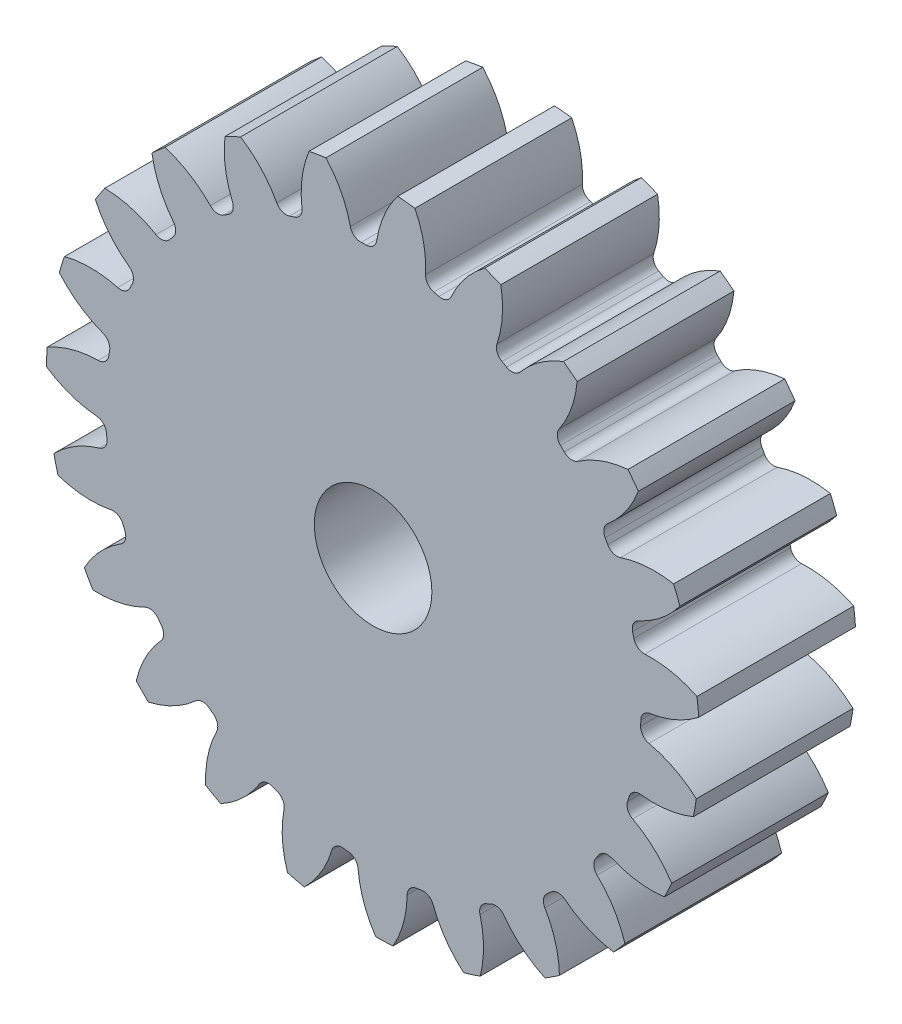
from build123d import *

# Parameters (mm, degrees)
SKETCH3_R         = 211.666666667
GEARBODY_DEPTH    = 101.6
TOOTHCUT_DEPTH    = 317.114086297
CIRPATTERN1_COUNT = 23
BOREDIA_R         = 38.1
BORE_DEPTH        = 12700


with BuildPart() as part:
    # Sketch3 → gearBody (new body)
    with BuildSketch(Plane.XY):
        Circle(SKETCH3_R)
    extrude(amount=GEARBODY_DEPTH)

    # Sketch2 → toothCut (cut, through all)
    with BuildSketch(Plane.XY):
        with BuildLine():
            ThreePointArc((173.401265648, -7.575542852), (173.46774755, -5.859038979), (173.51723815, -4.141961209))
            ThreePointArc((173.51723815, -4.141961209), (175.233036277, 0.246204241), (179.367154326, 2.506519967))
            ThreePointArc((179.367154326, 2.506519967), (196.444715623, 7.454335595), (211.666666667, 16.642163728))
            ThreePointArc((211.666666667, 16.642163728), (212.198893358, -7.16722045), (210.061342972, -30.886430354))
            ThreePointArc((210.061342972, -30.886430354), (195.494031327, -20.692441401), (178.789243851, -14.603594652))
            ThreePointArc((178.789243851, -14.603594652), (174.817062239, -12.069480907), (173.401265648, -7.575542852))
        make_face()
    toothcut = extrude(amount=TOOTHCUT_DEPTH, mode=Mode.SUBTRACT)

    # CirPattern1: toothCut ×23 about axis
    cirpattern1_axis = Axis((0, 0, 0), (0, 0, 1))
    for i in range(1, CIRPATTERN1_COUNT):
        add(toothcut.rotate(cirpattern1_axis, i * 360 / CIRPATTERN1_COUNT), mode=Mode.SUBTRACT)

    # boreDia → bore (cut, symmetric)
    with BuildSketch(Plane.XY):
        Circle(BOREDIA_R)
    extrude(amount=BORE_DEPTH, both=True, mode=Mode.SUBTRACT)


solid = part.part
